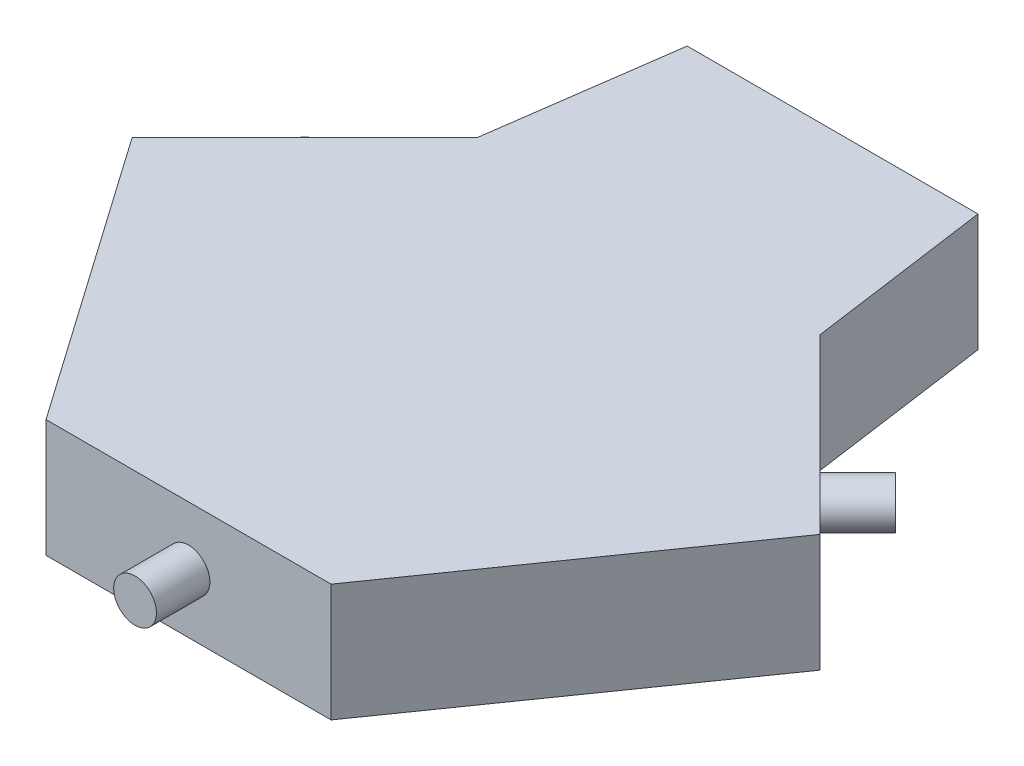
ISO-10303-21;
HEADER;
FILE_DESCRIPTION(('STEP AP214'),'2;1');
FILE_NAME('part.step','',(''),(''),'','','');
FILE_SCHEMA(('AUTOMOTIVE_DESIGN { 1 0 10303 214 1 1 1 1 }'));
ENDSEC;
DATA;
#1=APPLICATION_CONTEXT('core data for automotive mechanical design processes');
#2=APPLICATION_PROTOCOL_DEFINITION('international standard','automotive_design',2000,#1);
#3=PRODUCT_CONTEXT('',#1,'mechanical');
#4=PRODUCT('Part','Part','',(#3));
#5=PRODUCT_RELATED_PRODUCT_CATEGORY('part','',(#4));
#6=PRODUCT_DEFINITION_FORMATION('','',#4);
#7=PRODUCT_DEFINITION_CONTEXT('part definition',#1,'design');
#8=PRODUCT_DEFINITION('design','',#6,#7);
#9=PRODUCT_DEFINITION_SHAPE('','',#8);
#10=(LENGTH_UNIT() NAMED_UNIT(*) SI_UNIT(.MILLI.,.METRE.));
#11=(NAMED_UNIT(*) PLANE_ANGLE_UNIT() SI_UNIT($,.RADIAN.));
#12=(NAMED_UNIT(*) SI_UNIT($,.STERADIAN.) SOLID_ANGLE_UNIT());
#13=UNCERTAINTY_MEASURE_WITH_UNIT(LENGTH_MEASURE(1.E-05),#10,'distance_accuracy_value','');
#14=(GEOMETRIC_REPRESENTATION_CONTEXT(3) GLOBAL_UNCERTAINTY_ASSIGNED_CONTEXT((#13)) GLOBAL_UNIT_ASSIGNED_CONTEXT((#10,
#11,#12)) REPRESENTATION_CONTEXT('',''));
#15=CARTESIAN_POINT('',(0.,0.,0.));
#16=DIRECTION('',(0.,0.,1.));
#17=DIRECTION('',(1.,0.,0.));
#18=AXIS2_PLACEMENT_3D('',#15,#16,#17);
#19=CARTESIAN_POINT('',(-186.24582856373,55.,130.410733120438));
#20=DIRECTION('',(-0.81915204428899,0.,0.573576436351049));
#21=DIRECTION('',(0.573576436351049,0.,0.81915204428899));
#22=AXIS2_PLACEMENT_3D('',#19,#20,#21);
#23=PLANE('',#22);
#24=DIRECTION('',(-0.573576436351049,0.,-0.81915204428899));
#25=VECTOR('',#24,1.);
#26=CARTESIAN_POINT('',(-186.24582856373,0.,130.410733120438));
#27=LINE('',#26,#25);
#28=CARTESIAN_POINT('',(-66.653329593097,0.,301.206522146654));
#29=VERTEX_POINT('',#28);
#30=CARTESIAN_POINT('',(-160.779878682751,0.,166.779878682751));
#31=VERTEX_POINT('',#30);
#32=EDGE_CURVE('E130',#29,#31,#27,.T.);
#33=ORIENTED_EDGE('',*,*,#32,.F.);
#34=DIRECTION('',(0.,-1.,0.));
#35=VECTOR('',#34,1.);
#36=CARTESIAN_POINT('',(-66.653329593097,55.,301.206522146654));
#37=LINE('',#36,#35);
#38=CARTESIAN_POINT('',(-66.653329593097,55.,301.206522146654));
#39=VERTEX_POINT('',#38);
#40=EDGE_CURVE('E89',#39,#29,#37,.T.);
#41=ORIENTED_EDGE('',*,*,#40,.F.);
#42=DIRECTION('',(-0.573576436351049,0.,-0.81915204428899));
#43=VECTOR('',#42,1.);
#44=CARTESIAN_POINT('',(-186.24582856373,55.,130.410733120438));
#45=LINE('',#44,#43);
#46=CARTESIAN_POINT('',(-160.779878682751,55.,166.779878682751));
#47=VERTEX_POINT('',#46);
#48=EDGE_CURVE('E150',#39,#47,#45,.T.);
#49=ORIENTED_EDGE('',*,*,#48,.T.);
#50=DIRECTION('',(0.,-1.,0.));
#51=VECTOR('',#50,1.);
#52=CARTESIAN_POINT('',(-160.779878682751,55.,166.779878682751));
#53=LINE('',#52,#51);
#54=EDGE_CURVE('E84',#47,#31,#53,.T.);
#55=ORIENTED_EDGE('',*,*,#54,.T.);
#56=EDGE_LOOP('',(#33,#41,#49,#55));
#57=FACE_BOUND('',#56,.T.);
#58=ADVANCED_FACE('F33',(#57),#23,.T.);
#59=CARTESIAN_POINT('',(0.,55.,301.206522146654));
#60=DIRECTION('',(0.,0.,-1.));
#61=DIRECTION('',(-1.,0.,0.));
#62=AXIS2_PLACEMENT_3D('',#59,#60,#61);
#63=PLANE('',#62);
#64=CARTESIAN_POINT('',(0.,27.5,301.206522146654));
#65=DIRECTION('',(0.,0.,-1.));
#66=DIRECTION('',(-1.,0.,0.));
#67=AXIS2_PLACEMENT_3D('',#64,#65,#66);
#68=CIRCLE('',#67,10.);
#69=CARTESIAN_POINT('',(-9.99999999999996,27.5,301.206522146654));
#70=VERTEX_POINT('',#69);
#71=EDGE_CURVE('E41',#70,#70,#68,.F.);
#72=ORIENTED_EDGE('',*,*,#71,.F.);
#73=EDGE_LOOP('',(#72));
#74=FACE_BOUND('',#73,.T.);
#75=DIRECTION('',(1.,0.,0.));
#76=VECTOR('',#75,1.);
#77=CARTESIAN_POINT('',(0.,0.,301.206522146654));
#78=LINE('',#77,#76);
#79=CARTESIAN_POINT('',(66.6533295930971,0.,301.206522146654));
#80=VERTEX_POINT('',#79);
#81=EDGE_CURVE('E133',#29,#80,#78,.T.);
#82=ORIENTED_EDGE('',*,*,#81,.T.);
#83=DIRECTION('',(0.,-1.,0.));
#84=VECTOR('',#83,1.);
#85=CARTESIAN_POINT('',(66.6533295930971,55.,301.206522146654));
#86=LINE('',#85,#84);
#87=CARTESIAN_POINT('',(66.6533295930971,55.,301.206522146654));
#88=VERTEX_POINT('',#87);
#89=EDGE_CURVE('E158',#88,#80,#86,.T.);
#90=ORIENTED_EDGE('',*,*,#89,.F.);
#91=DIRECTION('',(1.,0.,0.));
#92=VECTOR('',#91,1.);
#93=CARTESIAN_POINT('',(0.,55.,301.206522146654));
#94=LINE('',#93,#92);
#95=EDGE_CURVE('E180',#39,#88,#94,.T.);
#96=ORIENTED_EDGE('',*,*,#95,.F.);
#97=ORIENTED_EDGE('',*,*,#40,.T.);
#98=EDGE_LOOP('',(#82,#90,#96,#97));
#99=FACE_BOUND('',#98,.T.);
#100=ADVANCED_FACE('F165',(#74,#99),#63,.F.);
#101=CARTESIAN_POINT('',(186.24582856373,55.,130.410733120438));
#102=DIRECTION('',(0.81915204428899,0.,0.573576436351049));
#103=DIRECTION('',(0.573576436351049,0.,-0.81915204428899));
#104=AXIS2_PLACEMENT_3D('',#101,#102,#103);
#105=PLANE('',#104);
#106=DIRECTION('',(-0.573576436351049,0.,0.81915204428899));
#107=VECTOR('',#106,1.);
#108=CARTESIAN_POINT('',(186.24582856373,0.,130.410733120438));
#109=LINE('',#108,#107);
#110=CARTESIAN_POINT('',(160.779878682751,0.,166.779878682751));
#111=VERTEX_POINT('',#110);
#112=EDGE_CURVE('E137',#111,#80,#109,.T.);
#113=ORIENTED_EDGE('',*,*,#112,.F.);
#114=DIRECTION('',(0.,-1.,0.));
#115=VECTOR('',#114,1.);
#116=CARTESIAN_POINT('',(160.779878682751,55.,166.779878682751));
#117=LINE('',#116,#115);
#118=CARTESIAN_POINT('',(160.779878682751,55.,166.779878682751));
#119=VERTEX_POINT('',#118);
#120=EDGE_CURVE('E156',#119,#111,#117,.T.);
#121=ORIENTED_EDGE('',*,*,#120,.F.);
#122=DIRECTION('',(-0.573576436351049,0.,0.81915204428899));
#123=VECTOR('',#122,1.);
#124=CARTESIAN_POINT('',(186.24582856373,55.,130.410733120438));
#125=LINE('',#124,#123);
#126=EDGE_CURVE('E178',#119,#88,#125,.T.);
#127=ORIENTED_EDGE('',*,*,#126,.T.);
#128=ORIENTED_EDGE('',*,*,#89,.T.);
#129=EDGE_LOOP('',(#113,#121,#127,#128));
#130=FACE_BOUND('',#129,.T.);
#131=ADVANCED_FACE('F168',(#130),#105,.T.);
#132=CARTESIAN_POINT('',(-2.99999999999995,55.,2.99999999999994));
#133=DIRECTION('',(0.707106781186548,0.,-0.707106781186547));
#134=DIRECTION('',(-0.707106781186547,0.,-0.707106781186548));
#135=AXIS2_PLACEMENT_3D('',#132,#133,#134);
#136=PLANE('',#135);
#137=CARTESIAN_POINT('',(120.389939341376,27.5,126.389939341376));
#138=DIRECTION('',(0.707106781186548,0.,-0.707106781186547));
#139=DIRECTION('',(-0.707106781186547,0.,-0.707106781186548));
#140=AXIS2_PLACEMENT_3D('',#137,#138,#139);
#141=CIRCLE('',#140,10.);
#142=CARTESIAN_POINT('',(113.31887152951,27.5,119.31887152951));
#143=VERTEX_POINT('',#142);
#144=EDGE_CURVE('E191',#143,#143,#141,.T.);
#145=ORIENTED_EDGE('',*,*,#144,.F.);
#146=EDGE_LOOP('',(#145));
#147=FACE_BOUND('',#146,.T.);
#148=DIRECTION('',(0.707106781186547,0.,0.707106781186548));
#149=VECTOR('',#148,1.);
#150=CARTESIAN_POINT('',(-2.99999999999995,0.,2.99999999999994));
#151=LINE('',#150,#149);
#152=CARTESIAN_POINT('',(80.,0.,86.));
#153=VERTEX_POINT('',#152);
#154=EDGE_CURVE('E140',#153,#111,#151,.T.);
#155=ORIENTED_EDGE('',*,*,#154,.F.);
#156=DIRECTION('',(0.,-1.,0.));
#157=VECTOR('',#156,1.);
#158=CARTESIAN_POINT('',(80.,55.,86.));
#159=LINE('',#158,#157);
#160=CARTESIAN_POINT('',(80.,55.,86.));
#161=VERTEX_POINT('',#160);
#162=EDGE_CURVE('E154',#161,#153,#159,.T.);
#163=ORIENTED_EDGE('',*,*,#162,.F.);
#164=DIRECTION('',(0.707106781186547,0.,0.707106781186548));
#165=VECTOR('',#164,1.);
#166=CARTESIAN_POINT('',(-2.99999999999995,55.,2.99999999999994));
#167=LINE('',#166,#165);
#168=EDGE_CURVE('E125',#161,#119,#167,.T.);
#169=ORIENTED_EDGE('',*,*,#168,.T.);
#170=ORIENTED_EDGE('',*,*,#120,.T.);
#171=EDGE_LOOP('',(#155,#163,#169,#170));
#172=FACE_BOUND('',#171,.T.);
#173=ADVANCED_FACE('F206',(#147,#172),#136,.T.);
#174=CARTESIAN_POINT('',(66.701326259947,55.,-9.30716180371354));
#175=DIRECTION('',(0.990404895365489,0.,-0.138196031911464));
#176=DIRECTION('',(-0.138196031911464,0.,-0.990404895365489));
#177=AXIS2_PLACEMENT_3D('',#174,#175,#176);
#178=PLANE('',#177);
#179=DIRECTION('',(0.138196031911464,0.,0.990404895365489));
#180=VECTOR('',#179,1.);
#181=CARTESIAN_POINT('',(66.701326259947,0.,-9.30716180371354));
#182=LINE('',#181,#180);
#183=CARTESIAN_POINT('',(68.,0.,0.));
#184=VERTEX_POINT('',#183);
#185=EDGE_CURVE('E143',#184,#153,#182,.T.);
#186=ORIENTED_EDGE('',*,*,#185,.F.);
#187=DIRECTION('',(0.,-1.,0.));
#188=VECTOR('',#187,1.);
#189=CARTESIAN_POINT('',(68.,55.,0.));
#190=LINE('',#189,#188);
#191=CARTESIAN_POINT('',(68.,55.,0.));
#192=VERTEX_POINT('',#191);
#193=EDGE_CURVE('E113',#192,#184,#190,.T.);
#194=ORIENTED_EDGE('',*,*,#193,.F.);
#195=DIRECTION('',(0.138196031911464,0.,0.990404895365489));
#196=VECTOR('',#195,1.);
#197=CARTESIAN_POINT('',(66.701326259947,55.,-9.30716180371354));
#198=LINE('',#197,#196);
#199=EDGE_CURVE('E123',#192,#161,#198,.T.);
#200=ORIENTED_EDGE('',*,*,#199,.T.);
#201=ORIENTED_EDGE('',*,*,#162,.T.);
#202=EDGE_LOOP('',(#186,#194,#200,#201));
#203=FACE_BOUND('',#202,.T.);
#204=ADVANCED_FACE('F209',(#203),#178,.T.);
#205=CARTESIAN_POINT('',(0.,55.,0.));
#206=DIRECTION('',(0.,0.,-1.));
#207=DIRECTION('',(-1.,0.,0.));
#208=AXIS2_PLACEMENT_3D('',#205,#206,#207);
#209=PLANE('',#208);
#210=DIRECTION('',(1.,0.,0.));
#211=VECTOR('',#210,1.);
#212=CARTESIAN_POINT('',(0.,0.,0.));
#213=LINE('',#212,#211);
#214=CARTESIAN_POINT('',(-68.,0.,0.));
#215=VERTEX_POINT('',#214);
#216=EDGE_CURVE('E112',#215,#184,#213,.T.);
#217=ORIENTED_EDGE('',*,*,#216,.F.);
#218=DIRECTION('',(0.,-1.,0.));
#219=VECTOR('',#218,1.);
#220=CARTESIAN_POINT('',(-68.,55.,0.));
#221=LINE('',#220,#219);
#222=CARTESIAN_POINT('',(-68.,55.,0.));
#223=VERTEX_POINT('',#222);
#224=EDGE_CURVE('E106',#223,#215,#221,.T.);
#225=ORIENTED_EDGE('',*,*,#224,.F.);
#226=DIRECTION('',(1.,0.,0.));
#227=VECTOR('',#226,1.);
#228=CARTESIAN_POINT('',(0.,55.,0.));
#229=LINE('',#228,#227);
#230=EDGE_CURVE('E110',#223,#192,#229,.T.);
#231=ORIENTED_EDGE('',*,*,#230,.T.);
#232=ORIENTED_EDGE('',*,*,#193,.T.);
#233=EDGE_LOOP('',(#217,#225,#231,#232));
#234=FACE_BOUND('',#233,.T.);
#235=ADVANCED_FACE('F108',(#234),#209,.T.);
#236=CARTESIAN_POINT('',(-66.701326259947,55.,-9.30716180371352));
#237=DIRECTION('',(0.990404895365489,0.,0.138196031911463));
#238=DIRECTION('',(0.138196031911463,0.,-0.990404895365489));
#239=AXIS2_PLACEMENT_3D('',#236,#237,#238);
#240=PLANE('',#239);
#241=DIRECTION('',(-0.138196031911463,0.,0.990404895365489));
#242=VECTOR('',#241,1.);
#243=CARTESIAN_POINT('',(-66.701326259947,0.,-9.30716180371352));
#244=LINE('',#243,#242);
#245=CARTESIAN_POINT('',(-80.,0.,86.));
#246=VERTEX_POINT('',#245);
#247=EDGE_CURVE('E77',#215,#246,#244,.T.);
#248=ORIENTED_EDGE('',*,*,#247,.T.);
#249=DIRECTION('',(0.,-1.,0.));
#250=VECTOR('',#249,1.);
#251=CARTESIAN_POINT('',(-80.,55.,86.));
#252=LINE('',#251,#250);
#253=CARTESIAN_POINT('',(-80.,55.,86.));
#254=VERTEX_POINT('',#253);
#255=EDGE_CURVE('E114',#254,#246,#252,.T.);
#256=ORIENTED_EDGE('',*,*,#255,.F.);
#257=DIRECTION('',(-0.138196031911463,0.,0.990404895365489));
#258=VECTOR('',#257,1.);
#259=CARTESIAN_POINT('',(-66.701326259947,55.,-9.30716180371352));
#260=LINE('',#259,#258);
#261=EDGE_CURVE('E116',#223,#254,#260,.T.);
#262=ORIENTED_EDGE('',*,*,#261,.F.);
#263=ORIENTED_EDGE('',*,*,#224,.T.);
#264=EDGE_LOOP('',(#248,#256,#262,#263));
#265=FACE_BOUND('',#264,.T.);
#266=ADVANCED_FACE('F117',(#265),#240,.F.);
#267=CARTESIAN_POINT('',(3.00000000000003,55.,3.00000000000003));
#268=DIRECTION('',(0.707106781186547,0.,0.707106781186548));
#269=DIRECTION('',(0.707106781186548,0.,-0.707106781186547));
#270=AXIS2_PLACEMENT_3D('',#267,#268,#269);
#271=PLANE('',#270);
#272=CARTESIAN_POINT('',(-120.389939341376,27.5,126.389939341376));
#273=DIRECTION('',(0.707106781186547,0.,0.707106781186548));
#274=DIRECTION('',(0.707106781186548,0.,-0.707106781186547));
#275=AXIS2_PLACEMENT_3D('',#272,#273,#274);
#276=CIRCLE('',#275,10.);
#277=CARTESIAN_POINT('',(-113.31887152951,27.5,119.31887152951));
#278=VERTEX_POINT('',#277);
#279=EDGE_CURVE('E11',#278,#278,#276,.F.);
#280=ORIENTED_EDGE('',*,*,#279,.F.);
#281=EDGE_LOOP('',(#280));
#282=FACE_BOUND('',#281,.T.);
#283=DIRECTION('',(-0.707106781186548,0.,0.707106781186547));
#284=VECTOR('',#283,1.);
#285=CARTESIAN_POINT('',(3.00000000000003,0.,3.00000000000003));
#286=LINE('',#285,#284);
#287=EDGE_CURVE('E148',#246,#31,#286,.T.);
#288=ORIENTED_EDGE('',*,*,#287,.T.);
#289=ORIENTED_EDGE('',*,*,#54,.F.);
#290=DIRECTION('',(-0.707106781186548,0.,0.707106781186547));
#291=VECTOR('',#290,1.);
#292=CARTESIAN_POINT('',(3.00000000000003,55.,3.00000000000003));
#293=LINE('',#292,#291);
#294=EDGE_CURVE('E49',#254,#47,#293,.T.);
#295=ORIENTED_EDGE('',*,*,#294,.F.);
#296=ORIENTED_EDGE('',*,*,#255,.T.);
#297=EDGE_LOOP('',(#288,#289,#295,#296));
#298=FACE_BOUND('',#297,.T.);
#299=ADVANCED_FACE('F224',(#282,#298),#271,.F.);
#300=CARTESIAN_POINT('',(0.,55.,0.));
#301=DIRECTION('',(0.,1.,0.));
#302=DIRECTION('',(0.,0.,1.));
#303=AXIS2_PLACEMENT_3D('',#300,#301,#302);
#304=PLANE('',#303);
#305=ORIENTED_EDGE('',*,*,#48,.F.);
#306=ORIENTED_EDGE('',*,*,#95,.T.);
#307=ORIENTED_EDGE('',*,*,#126,.F.);
#308=ORIENTED_EDGE('',*,*,#168,.F.);
#309=ORIENTED_EDGE('',*,*,#199,.F.);
#310=ORIENTED_EDGE('',*,*,#230,.F.);
#311=ORIENTED_EDGE('',*,*,#261,.T.);
#312=ORIENTED_EDGE('',*,*,#294,.T.);
#313=EDGE_LOOP('',(#305,#306,#307,#308,#309,#310,#311,#312));
#314=FACE_BOUND('',#313,.T.);
#315=ADVANCED_FACE('F120',(#314),#304,.T.);
#316=CARTESIAN_POINT('',(0.,0.,0.));
#317=DIRECTION('',(0.,1.,0.));
#318=DIRECTION('',(0.,0.,1.));
#319=AXIS2_PLACEMENT_3D('',#316,#317,#318);
#320=PLANE('',#319);
#321=ORIENTED_EDGE('',*,*,#32,.T.);
#322=ORIENTED_EDGE('',*,*,#287,.F.);
#323=ORIENTED_EDGE('',*,*,#247,.F.);
#324=ORIENTED_EDGE('',*,*,#216,.T.);
#325=ORIENTED_EDGE('',*,*,#185,.T.);
#326=ORIENTED_EDGE('',*,*,#154,.T.);
#327=ORIENTED_EDGE('',*,*,#112,.T.);
#328=ORIENTED_EDGE('',*,*,#81,.F.);
#329=EDGE_LOOP('',(#321,#322,#323,#324,#325,#326,#327,#328));
#330=FACE_BOUND('',#329,.T.);
#331=ADVANCED_FACE('F174',(#330),#320,.F.);
#332=CARTESIAN_POINT('',(0.,27.5,326.206522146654));
#333=DIRECTION('',(0.,0.,-1.));
#334=DIRECTION('',(-1.,0.,0.));
#335=AXIS2_PLACEMENT_3D('',#332,#333,#334);
#336=CYLINDRICAL_SURFACE('',#335,10.);
#337=CARTESIAN_POINT('',(0.,27.5,326.206522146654));
#338=DIRECTION('',(0.,0.,1.));
#339=DIRECTION('',(1.,0.,0.));
#340=AXIS2_PLACEMENT_3D('',#337,#338,#339);
#341=CIRCLE('',#340,10.);
#342=CARTESIAN_POINT('',(10.,27.5,326.206522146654));
#343=VERTEX_POINT('',#342);
#344=EDGE_CURVE('E134',#343,#343,#341,.T.);
#345=ORIENTED_EDGE('',*,*,#344,.F.);
#346=EDGE_LOOP('',(#345));
#347=FACE_BOUND('',#346,.T.);
#348=ORIENTED_EDGE('',*,*,#71,.T.);
#349=EDGE_LOOP('',(#348));
#350=FACE_BOUND('',#349,.T.);
#351=ADVANCED_FACE('F163',(#347,#350),#336,.T.);
#352=CARTESIAN_POINT('',(0.,27.5,326.206522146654));
#353=DIRECTION('',(0.,0.,1.));
#354=DIRECTION('',(1.,0.,0.));
#355=AXIS2_PLACEMENT_3D('',#352,#353,#354);
#356=PLANE('',#355);
#357=ORIENTED_EDGE('',*,*,#344,.T.);
#358=EDGE_LOOP('',(#357));
#359=FACE_BOUND('',#358,.T.);
#360=ADVANCED_FACE('F240',(#359),#356,.T.);
#361=CARTESIAN_POINT('',(-138.067608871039,27.5,108.712269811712));
#362=DIRECTION('',(0.707106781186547,0.,0.707106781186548));
#363=DIRECTION('',(0.707106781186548,0.,-0.707106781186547));
#364=AXIS2_PLACEMENT_3D('',#361,#362,#363);
#365=CYLINDRICAL_SURFACE('',#364,10.);
#366=CARTESIAN_POINT('',(-138.067608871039,27.5,108.712269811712));
#367=DIRECTION('',(-0.707106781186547,0.,-0.707106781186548));
#368=DIRECTION('',(-0.707106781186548,0.,0.707106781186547));
#369=AXIS2_PLACEMENT_3D('',#366,#367,#368);
#370=CIRCLE('',#369,10.);
#371=CARTESIAN_POINT('',(-145.138676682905,27.5,115.783337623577));
#372=VERTEX_POINT('',#371);
#373=EDGE_CURVE('E187',#372,#372,#370,.T.);
#374=ORIENTED_EDGE('',*,*,#373,.F.);
#375=EDGE_LOOP('',(#374));
#376=FACE_BOUND('',#375,.T.);
#377=ORIENTED_EDGE('',*,*,#279,.T.);
#378=EDGE_LOOP('',(#377));
#379=FACE_BOUND('',#378,.T.);
#380=ADVANCED_FACE('F244',(#376,#379),#365,.T.);
#381=CARTESIAN_POINT('',(-138.067608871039,27.5,108.712269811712));
#382=DIRECTION('',(-0.707106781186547,0.,-0.707106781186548));
#383=DIRECTION('',(-0.707106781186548,0.,0.707106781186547));
#384=AXIS2_PLACEMENT_3D('',#381,#382,#383);
#385=PLANE('',#384);
#386=ORIENTED_EDGE('',*,*,#373,.T.);
#387=EDGE_LOOP('',(#386));
#388=FACE_BOUND('',#387,.T.);
#389=ADVANCED_FACE('F202',(#388),#385,.T.);
#390=CARTESIAN_POINT('',(138.067608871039,27.5,108.712269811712));
#391=DIRECTION('',(-0.707106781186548,0.,0.707106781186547));
#392=DIRECTION('',(0.707106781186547,0.,0.707106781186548));
#393=AXIS2_PLACEMENT_3D('',#390,#391,#392);
#394=CYLINDRICAL_SURFACE('',#393,10.);
#395=CARTESIAN_POINT('',(138.067608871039,27.5,108.712269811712));
#396=DIRECTION('',(0.707106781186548,0.,-0.707106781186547));
#397=DIRECTION('',(-0.707106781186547,0.,-0.707106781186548));
#398=AXIS2_PLACEMENT_3D('',#395,#396,#397);
#399=CIRCLE('',#398,10.);
#400=CARTESIAN_POINT('',(130.996541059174,27.5,101.641201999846));
#401=VERTEX_POINT('',#400);
#402=EDGE_CURVE('E190',#401,#401,#399,.T.);
#403=ORIENTED_EDGE('',*,*,#402,.F.);
#404=EDGE_LOOP('',(#403));
#405=FACE_BOUND('',#404,.T.);
#406=ORIENTED_EDGE('',*,*,#144,.T.);
#407=EDGE_LOOP('',(#406));
#408=FACE_BOUND('',#407,.T.);
#409=ADVANCED_FACE('F199',(#405,#408),#394,.T.);
#410=CARTESIAN_POINT('',(138.067608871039,27.5,108.712269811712));
#411=DIRECTION('',(0.707106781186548,0.,-0.707106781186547));
#412=DIRECTION('',(-0.707106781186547,0.,-0.707106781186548));
#413=AXIS2_PLACEMENT_3D('',#410,#411,#412);
#414=PLANE('',#413);
#415=ORIENTED_EDGE('',*,*,#402,.T.);
#416=EDGE_LOOP('',(#415));
#417=FACE_BOUND('',#416,.T.);
#418=ADVANCED_FACE('F197',(#417),#414,.T.);
#419=CLOSED_SHELL('',(#58,#100,#131,#173,#204,#235,#266,#299,#315,#331,#351,#360,#380,#389,#409,#418));
#420=MANIFOLD_SOLID_BREP('B2',#419);
#421=ADVANCED_BREP_SHAPE_REPRESENTATION('',(#18,#420),#14);
#422=SHAPE_DEFINITION_REPRESENTATION(#9,#421);
ENDSEC;
END-ISO-10303-21;
